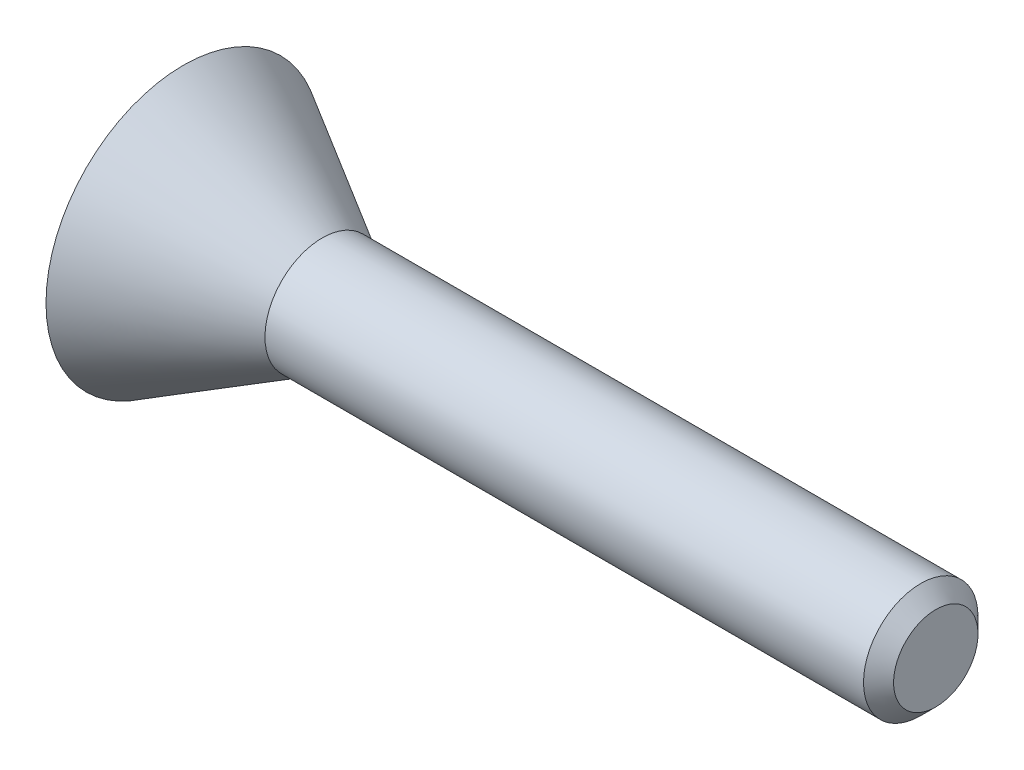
from build123d import *

# Parameters (mm, degrees)
SKETCH1_R           = 4.2
BOSS_EXTRUDE1_DEPTH = 11.5
CUT_EXTRUDE1_DEPTH  = 0.6
CHAMFER1_SIZE       = 0.46
CUT_EXTRUDE2_DEPTH  = 0.6


with BuildPart() as part:
    # Sketch1 → Boss-Extrude1 (new, symmetric)
    with BuildSketch(Plane(origin=(0, 0, 0), x_dir=(0, 0, -1), z_dir=(1, 0, 0))):
        Circle(SKETCH1_R)
    extrude(amount=BOSS_EXTRUDE1_DEPTH, both=True)

    # Sketch2 → Cut-Revolve1 (revolve, cut)
    with BuildSketch(Plane.XY, mode=Mode.PRIVATE) as cut_revolve1_sk:
        Polygon((-7.256475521, 1.75), (11.5, 1.75), (11.5, 4.2), (-11.5, 4.2), align=None)
    revolve(cut_revolve1_sk.sketch.rotate(Axis((-11.5, 0, 0), (1, 0, 0)), 180), axis=Axis((-11.5, 0, 0), (1, 0, 0)), mode=Mode.SUBTRACT)

    # Sketch3 → Cut-Extrude1 (cut)
    with BuildSketch(Plane.ZY.offset(11.5)):
        with BuildLine():
            Line((0.42, 1.85), (0.42, -2.77))
            ThreePointArc((0.42, -2.77), (0, -3.19), (-0.42, -2.77))
            Line((-0.42, -2.77), (-0.42, 1.85))
            Line((-0.42, 1.85), (-1.01, 1.85))
            Line((-1.01, 1.85), (0, 3.53))
            Line((0, 3.53), (1.01, 1.85))
            Line((1.01, 1.85), (0.42, 1.85))
        make_face()
    extrude(amount=-CUT_EXTRUDE1_DEPTH, mode=Mode.SUBTRACT)

    # Chamfer1
    chamfer1_edges = [part.edges().sort_by_distance(p)[0] for p in [
        (11.5, 1.75, 0),
    ]]
    chamfer(chamfer1_edges, length=CHAMFER1_SIZE)

    # Sketch4 → Cut-Extrude2 (cut)
    with BuildSketch(Plane.ZY.offset(11.5)):
        with BuildLine():
            Line((2.871357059, -1.810463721), (2.871357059, -1.317322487))
            Line((2.871357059, -1.317322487), (1.880366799, -0.004436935))
            add(Edge.make_bspline(
                [(1.880366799, -0.004436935), (1.859610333, 0.024810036), (1.81916699, 0.081796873), (1.782562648, 0.160056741), (1.759759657, 0.221413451), (1.748892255, 0.265909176), (1.741139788, 0.308362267), (1.740185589, 0.336257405), (1.739721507, 0.349824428)],
                knots=[0, 0, 0, 0, 1.664252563, 3.24274559, 3.998498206, 4.704056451, 5.369707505, 6, 6, 6, 6], degree=3))
            Line((1.739721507, 0.349824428), (1.739721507, 0.353943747))
            add(Edge.make_bspline(
                [(1.739721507, 0.353943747), (1.740525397, 0.372486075), (1.742065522, 0.40801022), (1.756575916, 0.458064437), (1.780357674, 0.501654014), (1.814418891, 0.537658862), (1.8568225, 0.566136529), (1.907559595, 0.586205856), (1.965966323, 0.597714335), (2.00742321, 0.599163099), (2.029250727, 0.59992589)],
                knots=[0, 0, 0, 0, 1.029992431, 1.973301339, 2.872554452, 3.768620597, 4.704316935, 5.693697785, 6.785705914, 8, 8, 8, 8], degree=3))
            add(Edge.make_bspline(
                [(2.029250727, 0.59992589), (2.05056998, 0.599094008), (2.09199403, 0.597477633), (2.150636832, 0.579563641), (2.203479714, 0.551464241), (2.249034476, 0.511369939), (2.28675727, 0.461030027), (2.317372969, 0.401750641), (2.338166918, 0.332461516), (2.345522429, 0.282861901), (2.349380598, 0.256845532)],
                knots=[0, 0, 0, 0, 0.980828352, 1.905783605, 2.800718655, 3.724477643, 4.680224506, 5.688112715, 6.78735127, 8, 8, 8, 8], degree=3))
            Line((2.349380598, 0.256845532), (2.349380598, 0.25508011))
            Line((2.349380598, 0.25508011), (2.907253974, 0.25508011))
            Line((2.907253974, 0.25508011), (2.907253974, 0.256845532))
            add(Edge.make_bspline(
                [(2.907253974, 0.256845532), (2.904501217, 0.290460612), (2.899127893, 0.356076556), (2.881511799, 0.450993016), (2.858743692, 0.540397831), (2.829779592, 0.624273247), (2.792560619, 0.701648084), (2.750743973, 0.774139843), (2.700449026, 0.839506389), (2.645394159, 0.899935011), (2.584072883, 0.953159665), (2.518687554, 1.00011095), (2.448249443, 1.039182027), (2.3738294, 1.071593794), (2.294602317, 1.096193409), (2.211603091, 1.114620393), (2.123879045, 1.125247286), (2.063999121, 1.126538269), (2.033370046, 1.127198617)],
                knots=[0, 0, 0, 0, 1.173229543, 2.290119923, 3.354877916, 4.382703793, 5.372196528, 6.339367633, 7.289741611, 8.236749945, 9.180232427, 10.11040526, 11.033485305, 11.978374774, 12.930610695, 13.916256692, 14.93414813, 16, 16, 16, 16], degree=3))
            add(Edge.make_bspline(
                [(2.033370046, 1.127198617), (2.000388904, 1.126730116), (1.936244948, 1.125818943), (1.842862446, 1.11598312), (1.754999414, 1.101137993), (1.672797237, 1.079420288), (1.596585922, 1.051091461), (1.526137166, 1.016933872), (1.461303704, 0.976656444), (1.402582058, 0.930173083), (1.349747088, 0.878328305), (1.304270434, 0.820595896), (1.26490285, 0.758142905), (1.23412948, 0.689758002), (1.208794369, 0.617049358), (1.192390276, 0.538713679), (1.181336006, 0.455673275), (1.180117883, 0.398510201), (1.179494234, 0.369244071)],
                knots=[0, 0, 0, 0, 1.219700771, 2.37215663, 3.469774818, 4.513610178, 5.512457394, 6.473141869, 7.405450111, 8.330272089, 9.238546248, 10.1372905, 11.043445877, 11.962355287, 12.905558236, 13.886315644, 14.917844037, 16, 16, 16, 16], degree=3))
            Line((1.179494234, 0.369244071), (1.179494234, 0.366890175))
            add(Edge.make_bspline(
                [(1.179494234, 0.366890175), (1.180244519, 0.333893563), (1.181746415, 0.267842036), (1.195303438, 0.168986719), (1.217150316, 0.070636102), (1.247153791, -0.026734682), (1.284425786, -0.121439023), (1.329159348, -0.212179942), (1.379646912, -0.298997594), (1.419653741, -0.352580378), (1.439599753, -0.37929489)],
                knots=[0, 0, 0, 0, 0.984368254, 1.970475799, 2.971844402, 3.988480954, 5.008197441, 6.005725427, 7.005724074, 8, 8, 8, 8], degree=3))
            Line((1.439599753, -0.37929489), (2.150476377, -1.283190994))
            Line((2.150476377, -1.283190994), (1.163605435, -1.283190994))
            Line((1.163605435, -1.283190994), (1.163605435, -1.810463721))
            Line((1.163605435, -1.810463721), (2.871357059, -1.810463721))
        make_face()
        Polygon((-2.691723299, 1.089536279), (-2.691723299, 0.725859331), (-2.04440187, -1.810463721), (-1.454750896, -1.810463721), (-2.082064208, 0.562263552), (-1.585980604, 0.562263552), (-1.585980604, 0.1103155), (-1.04164213, 0.1103155), (-1.04164213, 1.089536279), align=None)
    extrude(amount=-CUT_EXTRUDE2_DEPTH, mode=Mode.SUBTRACT)


solid = part.part
